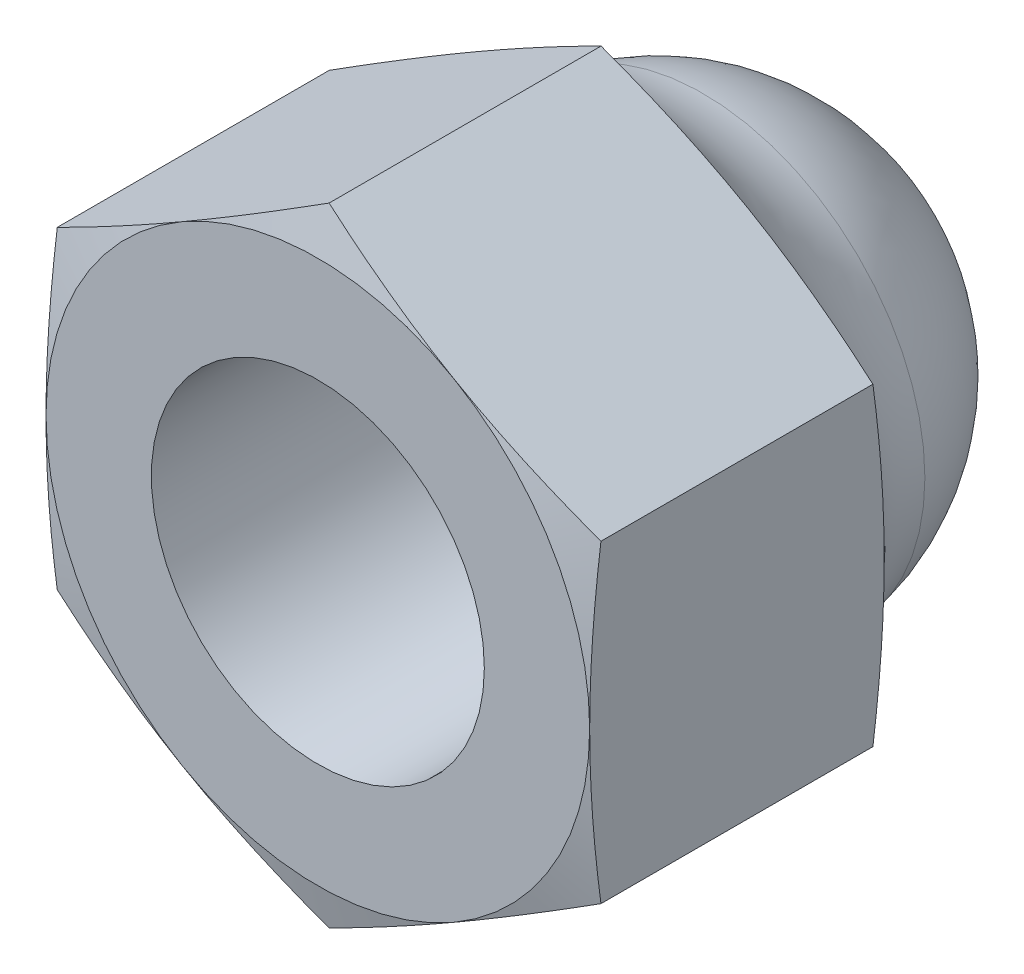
ISO-10303-21;
HEADER;
FILE_DESCRIPTION(('STEP AP214'),'2;1');
FILE_NAME('part.step','',(''),(''),'','','');
FILE_SCHEMA(('AUTOMOTIVE_DESIGN { 1 0 10303 214 1 1 1 1 }'));
ENDSEC;
DATA;
#1=APPLICATION_CONTEXT('core data for automotive mechanical design processes');
#2=APPLICATION_PROTOCOL_DEFINITION('international standard','automotive_design',2000,#1);
#3=PRODUCT_CONTEXT('',#1,'mechanical');
#4=PRODUCT('Part','Part','',(#3));
#5=PRODUCT_RELATED_PRODUCT_CATEGORY('part','',(#4));
#6=PRODUCT_DEFINITION_FORMATION('','',#4);
#7=PRODUCT_DEFINITION_CONTEXT('part definition',#1,'design');
#8=PRODUCT_DEFINITION('design','',#6,#7);
#9=PRODUCT_DEFINITION_SHAPE('','',#8);
#10=(LENGTH_UNIT() NAMED_UNIT(*) SI_UNIT(.MILLI.,.METRE.));
#11=(NAMED_UNIT(*) PLANE_ANGLE_UNIT() SI_UNIT($,.RADIAN.));
#12=(NAMED_UNIT(*) SI_UNIT($,.STERADIAN.) SOLID_ANGLE_UNIT());
#13=UNCERTAINTY_MEASURE_WITH_UNIT(LENGTH_MEASURE(1.E-05),#10,'distance_accuracy_value','');
#14=(GEOMETRIC_REPRESENTATION_CONTEXT(3) GLOBAL_UNCERTAINTY_ASSIGNED_CONTEXT((#13)) GLOBAL_UNIT_ASSIGNED_CONTEXT((#10,
#11,#12)) REPRESENTATION_CONTEXT('',''));
#15=CARTESIAN_POINT('',(0.,0.,0.));
#16=DIRECTION('',(0.,0.,1.));
#17=DIRECTION('',(1.,0.,0.));
#18=AXIS2_PLACEMENT_3D('',#15,#16,#17);
#19=CARTESIAN_POINT('',(0.,13.856406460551,12.9999999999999));
#20=DIRECTION('',(0.499999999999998,-0.86602540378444,0.));
#21=DIRECTION('',(0.866025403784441,0.5,0.));
#22=AXIS2_PLACEMENT_3D('',#19,#20,#21);
#23=PLANE('',#22);
#24=CARTESIAN_POINT('',(-12.0002000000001,6.92808776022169,0.497453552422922));
#25=CARTESIAN_POINT('',(-11.5018535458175,7.21580821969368,0.420327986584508));
#26=CARTESIAN_POINT('',(-11.0026035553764,7.50405033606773,0.350310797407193));
#27=CARTESIAN_POINT('',(-10.0023405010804,8.08155247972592,0.227297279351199));
#28=CARTESIAN_POINT('',(-9.50132680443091,8.37081287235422,0.174307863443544));
#29=CARTESIAN_POINT('',(-8.50057386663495,8.94859785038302,0.0884432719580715));
#30=CARTESIAN_POINT('',(-8.00084139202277,9.23711852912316,0.0554657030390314));
#31=CARTESIAN_POINT('',(-7.00073918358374,9.81452780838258,0.0112461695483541));
#32=CARTESIAN_POINT('',(-6.50036959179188,10.1034163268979,0.));
#33=CARTESIAN_POINT('',(-5.49963040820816,10.6811933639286,0.));
#34=CARTESIAN_POINT('',(-4.99926081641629,10.9700818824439,0.0112461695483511));
#35=CARTESIAN_POINT('',(-3.99915860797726,11.5474911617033,0.0554657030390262));
#36=CARTESIAN_POINT('',(-3.49942613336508,11.8360118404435,0.0884432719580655));
#37=CARTESIAN_POINT('',(-2.49867319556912,12.4137968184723,0.174307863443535));
#38=CARTESIAN_POINT('',(-1.99765949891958,12.7030572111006,0.227297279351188));
#39=CARTESIAN_POINT('',(-0.997396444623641,13.2805593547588,0.350310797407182));
#40=CARTESIAN_POINT('',(-0.498146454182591,13.5688014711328,0.4203279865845));
#41=CARTESIAN_POINT('',(0.000200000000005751,13.8565219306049,0.497453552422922));
#42=B_SPLINE_CURVE_WITH_KNOTS('',3,(#24,#25,#26,#27,#28,#29,#30,#31,#32,#33,#34,#35,#36,#37,#38,
#39,#40,#41),.UNSPECIFIED.,.F.,.F.,(4,2,2,2,2,2,2,2,4),(0.,1.74185054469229,3.48440735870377,
5.21797126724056,6.95119970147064,8.68442813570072,10.4179920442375,12.160548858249,
13.9023994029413),.UNSPECIFIED.);
#43=CARTESIAN_POINT('',(-12.,6.9282032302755,0.497422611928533));
#44=VERTEX_POINT('',#43);
#45=CARTESIAN_POINT('',(-5.99999999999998,10.3923048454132,0.));
#46=VERTEX_POINT('',#45);
#47=EDGE_CURVE('E330',#44,#46,#42,.T.);
#48=ORIENTED_EDGE('',*,*,#47,.F.);
#49=DIRECTION('',(0.,0.,-1.));
#50=VECTOR('',#49,1.);
#51=CARTESIAN_POINT('',(-12.,6.9282032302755,12.9999999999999));
#52=LINE('',#51,#50);
#53=CARTESIAN_POINT('',(-12.,6.9282032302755,12.5025773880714));
#54=VERTEX_POINT('',#53);
#55=EDGE_CURVE('E267',#54,#44,#52,.T.);
#56=ORIENTED_EDGE('',*,*,#55,.F.);
#57=CARTESIAN_POINT('',(0.000200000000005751,13.8565219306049,12.502546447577));
#58=CARTESIAN_POINT('',(-0.498146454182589,13.5688014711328,12.5796720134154));
#59=CARTESIAN_POINT('',(-0.99739644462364,13.2805593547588,12.6496892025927));
#60=CARTESIAN_POINT('',(-1.99765949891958,12.7030572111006,12.7727027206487));
#61=CARTESIAN_POINT('',(-2.49867319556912,12.4137968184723,12.8256921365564));
#62=CARTESIAN_POINT('',(-3.49942613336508,11.8360118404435,12.9115567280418));
#63=CARTESIAN_POINT('',(-3.99915860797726,11.5474911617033,12.9445342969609));
#64=CARTESIAN_POINT('',(-4.99926081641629,10.9700818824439,12.9887538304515));
#65=CARTESIAN_POINT('',(-5.49963040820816,10.6811933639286,12.9999999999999));
#66=CARTESIAN_POINT('',(-6.50036959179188,10.1034163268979,12.9999999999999));
#67=CARTESIAN_POINT('',(-7.00073918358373,9.81452780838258,12.9887538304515));
#68=CARTESIAN_POINT('',(-8.00084139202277,9.23711852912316,12.9445342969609));
#69=CARTESIAN_POINT('',(-8.50057386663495,8.94859785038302,12.9115567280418));
#70=CARTESIAN_POINT('',(-9.50132680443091,8.37081287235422,12.8256921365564));
#71=CARTESIAN_POINT('',(-10.0023405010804,8.08155247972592,12.7727027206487));
#72=CARTESIAN_POINT('',(-11.0026035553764,7.50405033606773,12.6496892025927));
#73=CARTESIAN_POINT('',(-11.5018535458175,7.21580821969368,12.5796720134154));
#74=CARTESIAN_POINT('',(-12.0002000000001,6.92808776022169,12.502546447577));
#75=B_SPLINE_CURVE_WITH_KNOTS('',3,(#57,#58,#59,#60,#61,#62,#63,#64,#65,#66,#67,#68,#69,#70,#71,
#72,#73,#74),.UNSPECIFIED.,.F.,.F.,(4,2,2,2,2,2,2,2,4),(0.,1.74185054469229,3.48440735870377,
5.21797126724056,6.95119970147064,8.68442813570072,10.4179920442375,12.160548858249,
13.9023994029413),.UNSPECIFIED.);
#76=CARTESIAN_POINT('',(-5.99999999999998,10.3923048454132,12.9999999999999));
#77=VERTEX_POINT('',#76);
#78=EDGE_CURVE('E240',#77,#54,#75,.T.);
#79=ORIENTED_EDGE('',*,*,#78,.F.);
#80=CARTESIAN_POINT('',(0.,13.856406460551,12.5025773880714));
#81=VERTEX_POINT('',#80);
#82=EDGE_CURVE('E497',#81,#77,#75,.T.);
#83=ORIENTED_EDGE('',*,*,#82,.F.);
#84=DIRECTION('',(0.,0.,-1.));
#85=VECTOR('',#84,1.);
#86=CARTESIAN_POINT('',(0.,13.856406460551,12.9999999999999));
#87=LINE('',#86,#85);
#88=CARTESIAN_POINT('',(0.,13.856406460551,0.497422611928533));
#89=VERTEX_POINT('',#88);
#90=EDGE_CURVE('E496',#81,#89,#87,.T.);
#91=ORIENTED_EDGE('',*,*,#90,.T.);
#92=EDGE_CURVE('E188',#46,#89,#42,.T.);
#93=ORIENTED_EDGE('',*,*,#92,.F.);
#94=EDGE_LOOP('',(#48,#56,#79,#83,#91,#93));
#95=FACE_BOUND('',#94,.T.);
#96=ADVANCED_FACE('F36',(#95),#23,.F.);
#97=CARTESIAN_POINT('',(-12.,6.9282032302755,12.9999999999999));
#98=DIRECTION('',(1.,0.,0.));
#99=DIRECTION('',(0.,1.,0.));
#100=AXIS2_PLACEMENT_3D('',#97,#98,#99);
#101=PLANE('',#100);
#102=CARTESIAN_POINT('',(-12.,-18.5110961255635,2.69567260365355));
#103=CARTESIAN_POINT('',(-11.9999999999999,-17.9641972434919,2.57274101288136));
#104=CARTESIAN_POINT('',(-11.9999999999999,-17.4169611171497,2.4512833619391));
#105=CARTESIAN_POINT('',(-11.9999999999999,-16.3216481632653,2.21211260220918));
#106=CARTESIAN_POINT('',(-11.9999999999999,-15.7735713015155,2.09439965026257));
#107=CARTESIAN_POINT('',(-11.9999999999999,-14.6759646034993,1.86342187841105));
#108=CARTESIAN_POINT('',(-11.9999999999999,-14.1264339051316,1.75016114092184));
#109=CARTESIAN_POINT('',(-11.9999999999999,-13.0262409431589,1.52927874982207));
#110=CARTESIAN_POINT('',(-11.9999999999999,-12.4755786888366,1.42165705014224));
#111=CARTESIAN_POINT('',(-11.9999999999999,-11.3780358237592,1.2143664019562));
#112=CARTESIAN_POINT('',(-11.9999999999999,-10.8311674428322,1.11463301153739));
#113=CARTESIAN_POINT('',(-11.9999999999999,-9.7359363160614,0.923670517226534));
#114=CARTESIAN_POINT('',(-11.9999999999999,-9.18757356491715,0.832441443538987));
#115=CARTESIAN_POINT('',(-11.9999999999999,-8.08922989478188,0.660502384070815));
#116=CARTESIAN_POINT('',(-11.9999999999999,-7.53924910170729,0.579791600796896));
#117=CARTESIAN_POINT('',(-11.9999999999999,-6.43753286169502,0.431233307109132));
#118=CARTESIAN_POINT('',(-12.,-5.88579741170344,0.36338581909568));
#119=CARTESIAN_POINT('',(-12.,-4.77420396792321,0.242424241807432));
#120=CARTESIAN_POINT('',(-12.,-4.21432606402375,0.189490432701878));
#121=CARTESIAN_POINT('',(-11.9999999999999,-3.09312446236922,0.101990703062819));
#122=CARTESIAN_POINT('',(-11.9999999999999,-2.53180079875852,0.0674243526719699));
#123=CARTESIAN_POINT('',(-12.,-1.40855850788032,0.01867211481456));
#124=CARTESIAN_POINT('',(-12.,-0.846640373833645,0.00447509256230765));
#125=CARTESIAN_POINT('',(-12.,0.277333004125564,-0.00266607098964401));
#126=CARTESIAN_POINT('',(-12.,0.839388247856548,0.0043897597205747));
#127=CARTESIAN_POINT('',(-12.,1.96555186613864,0.0393808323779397));
#128=CARTESIAN_POINT('',(-12.,2.52965704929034,0.0674167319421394));
#129=CARTESIAN_POINT('',(-12.,3.65656541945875,0.142778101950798));
#130=CARTESIAN_POINT('',(-12.,4.21936857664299,0.190104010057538));
#131=CARTESIAN_POINT('',(-12.,5.34370363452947,0.301609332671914));
#132=CARTESIAN_POINT('',(-12.,5.90523426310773,0.365801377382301));
#133=CARTESIAN_POINT('',(-12.,7.0264725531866,0.508309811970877));
#134=CARTESIAN_POINT('',(-12.0000000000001,7.58618022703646,0.586626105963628));
#135=CARTESIAN_POINT('',(-12.0000000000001,8.86380356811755,0.778875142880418));
#136=CARTESIAN_POINT('',(-12.,9.58114681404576,0.89658607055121));
#137=CARTESIAN_POINT('',(-12.,11.0133231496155,1.14649080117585));
#138=CARTESIAN_POINT('',(-12.,11.7281560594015,1.27868562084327));
#139=CARTESIAN_POINT('',(-12.,13.1558741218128,1.55404136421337));
#140=CARTESIAN_POINT('',(-12.,13.8687587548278,1.69720496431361));
#141=CARTESIAN_POINT('',(-12.,15.2927836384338,1.99182633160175));
#142=CARTESIAN_POINT('',(-12.,16.0039239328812,2.14328388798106));
#143=CARTESIAN_POINT('',(-12.,17.425302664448,2.4526655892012));
#144=CARTESIAN_POINT('',(-12.,18.1355401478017,2.610594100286));
#145=CARTESIAN_POINT('',(-12.,19.5548982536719,2.93139502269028));
#146=CARTESIAN_POINT('',(-12.,20.2640188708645,3.09426745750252));
#147=CARTESIAN_POINT('',(-12.,21.6812515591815,3.42387412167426));
#148=CARTESIAN_POINT('',(-12.,22.3893637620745,3.59060778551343));
#149=CARTESIAN_POINT('',(-12.,23.8048483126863,3.92717574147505));
#150=CARTESIAN_POINT('',(-12.,24.5122206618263,4.09701002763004));
#151=CARTESIAN_POINT('',(-12.,26.6091583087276,4.60435907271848));
#152=CARTESIAN_POINT('',(-12.0000000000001,27.9978639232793,4.94542535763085));
#153=CARTESIAN_POINT('',(-12.0000000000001,30.7737273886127,5.63403087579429));
#154=CARTESIAN_POINT('',(-12.0000000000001,32.1608851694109,5.98157039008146));
#155=CARTESIAN_POINT('',(-12.0000000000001,34.9312190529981,6.68051050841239));
#156=CARTESIAN_POINT('',(-12.0000000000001,36.3143975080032,7.03190179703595));
#157=CARTESIAN_POINT('',(-12.0000000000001,38.388490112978,7.56147359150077));
#158=CARTESIAN_POINT('',(-12.0000000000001,39.079723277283,7.73840688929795));
#159=CARTESIAN_POINT('',(-12.0000000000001,40.4620031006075,8.09299867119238));
#160=CARTESIAN_POINT('',(-12.0000000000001,41.1530497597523,8.27065715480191));
#161=CARTESIAN_POINT('',(-12.0000000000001,41.8440167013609,8.44862526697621));
#162=B_SPLINE_CURVE_WITH_KNOTS('',3,(#102,#103,#104,#105,#106,#107,#108,#109,#110,#111,#112,
#113,#114,#115,#116,#117,#118,#119,#120,#121,#122,#123,#124,#125,#126,#127,#128,#129,#130,#131,
#132,#133,#134,#135,#136,#137,#138,#139,#140,#141,#142,#143,#144,#145,#146,#147,#148,#149,#150,
#151,#152,#153,#154,#155,#156,#157,#158,#159,#160,#161),.UNSPECIFIED.,.F.,.F.,(4,2,2,2,2,2,2,2,
2,2,2,2,2,2,2,2,2,2,2,2,2,2,2,2,2,2,2,2,2,4),(0.,1.68164127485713,3.36335289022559,
5.04657218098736,6.72977771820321,8.39738893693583,10.0650060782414,11.7324967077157,
13.399990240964,15.0868515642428,16.7736734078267,18.4595728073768,20.1454699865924,
21.8395079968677,23.5335844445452,25.2289331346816,26.9242703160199,29.1048720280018,
31.2856269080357,33.4669156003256,35.6481488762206,37.8308789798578,40.0136194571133,
42.1960422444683,44.3784608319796,48.6683599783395,52.958445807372,57.2397859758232,
59.380341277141,61.5208951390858),.UNSPECIFIED.);
#163=CARTESIAN_POINT('',(-12.,-6.92820323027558,0.497422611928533));
#164=VERTEX_POINT('',#163);
#165=CARTESIAN_POINT('',(-12.,0.,0.));
#166=VERTEX_POINT('',#165);
#167=EDGE_CURVE('E52',#164,#166,#162,.T.);
#168=ORIENTED_EDGE('',*,*,#167,.F.);
#169=DIRECTION('',(0.,0.,-1.));
#170=VECTOR('',#169,1.);
#171=CARTESIAN_POINT('',(-12.,-6.92820323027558,12.9999999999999));
#172=LINE('',#171,#170);
#173=CARTESIAN_POINT('',(-12.,-6.92820323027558,12.5025773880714));
#174=VERTEX_POINT('',#173);
#175=EDGE_CURVE('E260',#174,#164,#172,.T.);
#176=ORIENTED_EDGE('',*,*,#175,.F.);
#177=CARTESIAN_POINT('',(-12.,-18.5110961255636,10.3043273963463));
#178=CARTESIAN_POINT('',(-12.,-17.964197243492,10.4272589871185));
#179=CARTESIAN_POINT('',(-11.9999999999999,-17.4169611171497,10.5487166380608));
#180=CARTESIAN_POINT('',(-11.9999999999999,-16.3216481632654,10.7878873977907));
#181=CARTESIAN_POINT('',(-11.9999999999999,-15.7735713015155,10.9056003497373));
#182=CARTESIAN_POINT('',(-11.9999999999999,-14.6759646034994,11.1365781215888));
#183=CARTESIAN_POINT('',(-11.9999999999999,-14.1264339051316,11.2498388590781));
#184=CARTESIAN_POINT('',(-11.9999999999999,-13.0262409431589,11.4707212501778));
#185=CARTESIAN_POINT('',(-11.9999999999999,-12.4755786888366,11.5783429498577));
#186=CARTESIAN_POINT('',(-11.9999999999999,-11.3780358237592,11.7856335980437));
#187=CARTESIAN_POINT('',(-11.9999999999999,-10.8311674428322,11.8853669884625));
#188=CARTESIAN_POINT('',(-11.9999999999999,-9.73593631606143,12.0763294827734));
#189=CARTESIAN_POINT('',(-11.9999999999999,-9.18757356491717,12.1675585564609));
#190=CARTESIAN_POINT('',(-11.9999999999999,-8.0892298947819,12.3394976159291));
#191=CARTESIAN_POINT('',(-11.9999999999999,-7.53924910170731,12.420208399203));
#192=CARTESIAN_POINT('',(-11.9999999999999,-6.43753286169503,12.5687666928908));
#193=CARTESIAN_POINT('',(-12.,-5.88579741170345,12.6366141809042));
#194=CARTESIAN_POINT('',(-12.,-4.77420396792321,12.7575757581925));
#195=CARTESIAN_POINT('',(-12.,-4.21432606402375,12.810509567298));
#196=CARTESIAN_POINT('',(-11.9999999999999,-3.09312446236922,12.8980092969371));
#197=CARTESIAN_POINT('',(-11.9999999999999,-2.53180079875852,12.9325756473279));
#198=CARTESIAN_POINT('',(-12.,-1.40855850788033,12.9813278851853));
#199=CARTESIAN_POINT('',(-12.,-0.846640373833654,12.9955249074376));
#200=CARTESIAN_POINT('',(-12.,0.277333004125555,13.0026660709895));
#201=CARTESIAN_POINT('',(-12.,0.839388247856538,12.9956102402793));
#202=CARTESIAN_POINT('',(-12.,1.96555186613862,12.960619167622));
#203=CARTESIAN_POINT('',(-12.,2.52965704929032,12.9325832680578));
#204=CARTESIAN_POINT('',(-12.,3.65656541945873,12.8572218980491));
#205=CARTESIAN_POINT('',(-12.,4.21936857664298,12.8098959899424));
#206=CARTESIAN_POINT('',(-12.,5.34370363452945,12.698390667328));
#207=CARTESIAN_POINT('',(-12.,5.90523426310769,12.6341986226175));
#208=CARTESIAN_POINT('',(-12.,7.02647255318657,12.4916901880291));
#209=CARTESIAN_POINT('',(-12.,7.58618022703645,12.4133738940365));
#210=CARTESIAN_POINT('',(-12.,8.86380356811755,12.2211248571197));
#211=CARTESIAN_POINT('',(-12.,9.58114681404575,12.1034139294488));
#212=CARTESIAN_POINT('',(-12.,11.0133231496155,11.853509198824));
#213=CARTESIAN_POINT('',(-12.,11.7281560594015,11.7213143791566));
#214=CARTESIAN_POINT('',(-12.,13.1558741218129,11.4459586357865));
#215=CARTESIAN_POINT('',(-12.,13.8687587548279,11.3027950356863));
#216=CARTESIAN_POINT('',(-12.,15.2927836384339,11.0081736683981));
#217=CARTESIAN_POINT('',(-12.,16.0039239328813,10.8567161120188));
#218=CARTESIAN_POINT('',(-12.,17.4253026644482,10.5473344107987));
#219=CARTESIAN_POINT('',(-12.,18.1355401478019,10.3894058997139));
#220=CARTESIAN_POINT('',(-12.,19.5548982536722,10.0686049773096));
#221=CARTESIAN_POINT('',(-12.,20.2640188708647,9.90573254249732));
#222=CARTESIAN_POINT('',(-12.,21.6812515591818,9.57612587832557));
#223=CARTESIAN_POINT('',(-12.,22.3893637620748,9.40939221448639));
#224=CARTESIAN_POINT('',(-12.,23.8048483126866,9.07282425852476));
#225=CARTESIAN_POINT('',(-12.,24.5122206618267,8.90298997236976));
#226=CARTESIAN_POINT('',(-12.,26.6091583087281,8.39564092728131));
#227=CARTESIAN_POINT('',(-12.0000000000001,27.9978639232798,8.05457464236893));
#228=CARTESIAN_POINT('',(-12.0000000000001,30.7737273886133,7.36596912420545));
#229=CARTESIAN_POINT('',(-12.0000000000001,32.1608851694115,7.01842960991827));
#230=CARTESIAN_POINT('',(-12.0000000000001,34.9312190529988,6.31948949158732));
#231=CARTESIAN_POINT('',(-12.0000000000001,36.314397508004,5.96809820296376));
#232=CARTESIAN_POINT('',(-12.0000000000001,38.3884901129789,5.4385264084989));
#233=CARTESIAN_POINT('',(-12.0000000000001,39.0797232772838,5.26159311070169));
#234=CARTESIAN_POINT('',(-12.0000000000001,40.4620031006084,4.9070013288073));
#235=CARTESIAN_POINT('',(-12.0000000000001,41.1530497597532,4.72934284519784));
#236=CARTESIAN_POINT('',(-12.0000000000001,41.844016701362,4.55137473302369));
#237=B_SPLINE_CURVE_WITH_KNOTS('',3,(#177,#178,#179,#180,#181,#182,#183,#184,#185,#186,#187,
#188,#189,#190,#191,#192,#193,#194,#195,#196,#197,#198,#199,#200,#201,#202,#203,#204,#205,#206,
#207,#208,#209,#210,#211,#212,#213,#214,#215,#216,#217,#218,#219,#220,#221,#222,#223,#224,#225,
#226,#227,#228,#229,#230,#231,#232,#233,#234,#235,#236),.UNSPECIFIED.,.F.,.F.,(4,2,2,2,2,2,2,2,
2,2,2,2,2,2,2,2,2,2,2,2,2,2,2,2,2,2,2,2,2,4),(0.,1.68164127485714,3.3633528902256,
5.04657218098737,6.72977771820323,8.39738893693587,10.0650060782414,11.7324967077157,
13.399990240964,15.0868515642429,16.7736734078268,18.4595728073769,20.1454699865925,
21.8395079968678,23.5335844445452,25.2289331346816,26.9242703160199,29.1048720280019,
31.2856269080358,33.4669156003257,35.6481488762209,37.8308789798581,40.0136194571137,
42.1960422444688,44.37846083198,48.6683599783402,52.9584458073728,57.2397859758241,
59.380341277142,61.5208951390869),.UNSPECIFIED.);
#238=CARTESIAN_POINT('',(-12.0000000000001,0.,12.9999999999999));
#239=VERTEX_POINT('',#238);
#240=EDGE_CURVE('E234',#239,#174,#237,.F.);
#241=ORIENTED_EDGE('',*,*,#240,.F.);
#242=EDGE_CURVE('E239',#54,#239,#237,.F.);
#243=ORIENTED_EDGE('',*,*,#242,.F.);
#244=ORIENTED_EDGE('',*,*,#55,.T.);
#245=EDGE_CURVE('E199',#166,#44,#162,.T.);
#246=ORIENTED_EDGE('',*,*,#245,.F.);
#247=EDGE_LOOP('',(#168,#176,#241,#243,#244,#246));
#248=FACE_BOUND('',#247,.T.);
#249=ADVANCED_FACE('F245',(#248),#101,.F.);
#250=CARTESIAN_POINT('',(0.,-13.8564064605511,12.9999999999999));
#251=DIRECTION('',(0.5,0.86602540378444,0.));
#252=DIRECTION('',(-0.866025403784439,0.499999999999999,0.));
#253=AXIS2_PLACEMENT_3D('',#250,#251,#252);
#254=PLANE('',#253);
#255=CARTESIAN_POINT('',(0.000200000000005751,-13.8565219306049,0.497453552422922));
#256=CARTESIAN_POINT('',(-0.498146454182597,-13.5688014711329,0.420327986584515));
#257=CARTESIAN_POINT('',(-0.997396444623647,-13.2805593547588,0.350310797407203));
#258=CARTESIAN_POINT('',(-1.99765949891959,-12.7030572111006,0.227297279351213));
#259=CARTESIAN_POINT('',(-2.49867319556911,-12.4137968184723,0.174307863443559));
#260=CARTESIAN_POINT('',(-3.49942613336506,-11.8360118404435,0.0884432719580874));
#261=CARTESIAN_POINT('',(-3.99915860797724,-11.5474911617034,0.0554657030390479));
#262=CARTESIAN_POINT('',(-4.99926081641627,-10.970081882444,0.0112461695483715));
#263=CARTESIAN_POINT('',(-5.49963040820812,-10.6811933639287,0.));
#264=CARTESIAN_POINT('',(-6.50036959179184,-10.103416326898,0.));
#265=CARTESIAN_POINT('',(-7.00073918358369,-9.81452780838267,0.0112461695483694));
#266=CARTESIAN_POINT('',(-8.00084139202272,-9.23711852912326,0.0554657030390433));
#267=CARTESIAN_POINT('',(-8.5005738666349,-8.94859785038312,0.0884432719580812));
#268=CARTESIAN_POINT('',(-9.50132680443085,-8.37081287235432,0.174307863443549));
#269=CARTESIAN_POINT('',(-10.0023405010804,-8.08155247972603,0.227297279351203));
#270=CARTESIAN_POINT('',(-11.0026035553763,-7.50405033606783,0.350310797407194));
#271=CARTESIAN_POINT('',(-11.5018535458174,-7.21580821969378,0.420327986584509));
#272=CARTESIAN_POINT('',(-12.0002,-6.92808776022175,0.497453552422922));
#273=B_SPLINE_CURVE_WITH_KNOTS('',3,(#255,#256,#257,#258,#259,#260,#261,#262,#263,#264,#265,
#266,#267,#268,#269,#270,#271,#272),.UNSPECIFIED.,.F.,.F.,(4,2,2,2,2,2,2,2,4),(0.,
1.74185054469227,3.48440735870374,5.21797126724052,6.95119970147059,8.68442813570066,
10.4179920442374,12.1605488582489,13.9023994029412),.UNSPECIFIED.);
#274=CARTESIAN_POINT('',(0.,-13.8564064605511,0.497422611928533));
#275=VERTEX_POINT('',#274);
#276=CARTESIAN_POINT('',(-5.99999999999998,-10.3923048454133,0.));
#277=VERTEX_POINT('',#276);
#278=EDGE_CURVE('E60',#275,#277,#273,.T.);
#279=ORIENTED_EDGE('',*,*,#278,.F.);
#280=DIRECTION('',(0.,0.,-1.));
#281=VECTOR('',#280,1.);
#282=CARTESIAN_POINT('',(0.,-13.8564064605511,12.9999999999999));
#283=LINE('',#282,#281);
#284=CARTESIAN_POINT('',(0.,-13.8564064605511,12.5025773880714));
#285=VERTEX_POINT('',#284);
#286=EDGE_CURVE('E268',#285,#275,#283,.T.);
#287=ORIENTED_EDGE('',*,*,#286,.F.);
#288=CARTESIAN_POINT('',(-12.0002,-6.92808776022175,12.502546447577));
#289=CARTESIAN_POINT('',(-11.5018535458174,-7.21580821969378,12.5796720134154));
#290=CARTESIAN_POINT('',(-11.0026035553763,-7.50405033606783,12.6496892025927));
#291=CARTESIAN_POINT('',(-10.0023405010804,-8.08155247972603,12.7727027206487));
#292=CARTESIAN_POINT('',(-9.50132680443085,-8.37081287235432,12.8256921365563));
#293=CARTESIAN_POINT('',(-8.5005738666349,-8.94859785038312,12.9115567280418));
#294=CARTESIAN_POINT('',(-8.00084139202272,-9.23711852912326,12.9445342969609));
#295=CARTESIAN_POINT('',(-7.00073918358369,-9.81452780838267,12.9887538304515));
#296=CARTESIAN_POINT('',(-6.50036959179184,-10.103416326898,12.9999999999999));
#297=CARTESIAN_POINT('',(-5.49963040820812,-10.6811933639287,12.9999999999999));
#298=CARTESIAN_POINT('',(-4.99926081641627,-10.970081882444,12.9887538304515));
#299=CARTESIAN_POINT('',(-3.99915860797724,-11.5474911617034,12.9445342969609));
#300=CARTESIAN_POINT('',(-3.49942613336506,-11.8360118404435,12.9115567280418));
#301=CARTESIAN_POINT('',(-2.49867319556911,-12.4137968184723,12.8256921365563));
#302=CARTESIAN_POINT('',(-1.99765949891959,-12.7030572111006,12.7727027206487));
#303=CARTESIAN_POINT('',(-0.997396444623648,-13.2805593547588,12.6496892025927));
#304=CARTESIAN_POINT('',(-0.498146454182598,-13.5688014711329,12.5796720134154));
#305=CARTESIAN_POINT('',(0.000200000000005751,-13.8565219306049,12.502546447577));
#306=B_SPLINE_CURVE_WITH_KNOTS('',3,(#288,#289,#290,#291,#292,#293,#294,#295,#296,#297,#298,
#299,#300,#301,#302,#303,#304,#305),.UNSPECIFIED.,.F.,.F.,(4,2,2,2,2,2,2,2,4),(0.,
1.74185054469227,3.48440735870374,5.21797126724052,6.95119970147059,8.68442813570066,
10.4179920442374,12.1605488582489,13.9023994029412),.UNSPECIFIED.);
#307=CARTESIAN_POINT('',(-5.99999999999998,-10.3923048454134,12.9999999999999));
#308=VERTEX_POINT('',#307);
#309=EDGE_CURVE('E228',#308,#285,#306,.T.);
#310=ORIENTED_EDGE('',*,*,#309,.F.);
#311=EDGE_CURVE('E233',#174,#308,#306,.T.);
#312=ORIENTED_EDGE('',*,*,#311,.F.);
#313=ORIENTED_EDGE('',*,*,#175,.T.);
#314=EDGE_CURVE('E178',#277,#164,#273,.T.);
#315=ORIENTED_EDGE('',*,*,#314,.F.);
#316=EDGE_LOOP('',(#279,#287,#310,#312,#313,#315));
#317=FACE_BOUND('',#316,.T.);
#318=ADVANCED_FACE('F209',(#317),#254,.F.);
#319=CARTESIAN_POINT('',(0.,-13.8564064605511,12.9999999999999));
#320=DIRECTION('',(-0.499999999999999,0.866025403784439,0.));
#321=DIRECTION('',(-0.86602540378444,-0.500000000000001,0.));
#322=AXIS2_PLACEMENT_3D('',#319,#320,#321);
#323=PLANE('',#322);
#324=CARTESIAN_POINT('',(12.0002,-6.92808776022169,0.497453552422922));
#325=CARTESIAN_POINT('',(11.5018535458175,-7.21580821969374,0.42032798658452));
#326=CARTESIAN_POINT('',(11.0026035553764,-7.50405033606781,0.350310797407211));
#327=CARTESIAN_POINT('',(10.0023405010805,-8.08155247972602,0.227297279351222));
#328=CARTESIAN_POINT('',(9.50132680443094,-8.37081287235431,0.174307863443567));
#329=CARTESIAN_POINT('',(8.50057386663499,-8.94859785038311,0.0884432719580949));
#330=CARTESIAN_POINT('',(8.00084139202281,-9.23711852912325,0.0554657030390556));
#331=CARTESIAN_POINT('',(7.00073918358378,-9.81452780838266,0.0112461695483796));
#332=CARTESIAN_POINT('',(6.50036959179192,-10.103416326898,0.));
#333=CARTESIAN_POINT('',(5.4996304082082,-10.6811933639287,0.));
#334=CARTESIAN_POINT('',(4.99926081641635,-10.970081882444,0.011246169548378));
#335=CARTESIAN_POINT('',(3.99915860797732,-11.5474911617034,0.0554657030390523));
#336=CARTESIAN_POINT('',(3.49942613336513,-11.8360118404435,0.0884432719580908));
#337=CARTESIAN_POINT('',(2.49867319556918,-12.4137968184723,0.17430786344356));
#338=CARTESIAN_POINT('',(1.99765949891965,-12.7030572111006,0.227297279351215));
#339=CARTESIAN_POINT('',(0.997396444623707,-13.2805593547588,0.350310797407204));
#340=CARTESIAN_POINT('',(0.498146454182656,-13.5688014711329,0.420327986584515));
#341=CARTESIAN_POINT('',(-0.00019999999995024,-13.8565219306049,0.497453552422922));
#342=B_SPLINE_CURVE_WITH_KNOTS('',3,(#324,#325,#326,#327,#328,#329,#330,#331,#332,#333,#334,
#335,#336,#337,#338,#339,#340,#341),.UNSPECIFIED.,.F.,.F.,(4,2,2,2,2,2,2,2,4),(0.,
1.74185054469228,3.48440735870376,5.21797126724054,6.95119970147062,8.68442813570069,
10.4179920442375,12.160548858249,13.9023994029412),.UNSPECIFIED.);
#343=CARTESIAN_POINT('',(12.,-6.92820323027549,0.497422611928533));
#344=VERTEX_POINT('',#343);
#345=CARTESIAN_POINT('',(6.00000000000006,-10.3923048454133,0.));
#346=VERTEX_POINT('',#345);
#347=EDGE_CURVE('E193',#344,#346,#342,.T.);
#348=ORIENTED_EDGE('',*,*,#347,.F.);
#349=DIRECTION('',(0.,0.,-1.));
#350=VECTOR('',#349,1.);
#351=CARTESIAN_POINT('',(12.,-6.92820323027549,12.9999999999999));
#352=LINE('',#351,#350);
#353=CARTESIAN_POINT('',(12.,-6.92820323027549,12.5025773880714));
#354=VERTEX_POINT('',#353);
#355=EDGE_CURVE('E273',#354,#344,#352,.T.);
#356=ORIENTED_EDGE('',*,*,#355,.F.);
#357=CARTESIAN_POINT('',(-0.00019999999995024,-13.8565219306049,12.502546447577));
#358=CARTESIAN_POINT('',(0.498146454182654,-13.5688014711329,12.5796720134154));
#359=CARTESIAN_POINT('',(0.997396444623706,-13.2805593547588,12.6496892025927));
#360=CARTESIAN_POINT('',(1.99765949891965,-12.7030572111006,12.7727027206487));
#361=CARTESIAN_POINT('',(2.49867319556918,-12.4137968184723,12.8256921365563));
#362=CARTESIAN_POINT('',(3.49942613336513,-11.8360118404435,12.9115567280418));
#363=CARTESIAN_POINT('',(3.99915860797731,-11.5474911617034,12.9445342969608));
#364=CARTESIAN_POINT('',(4.99926081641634,-10.970081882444,12.9887538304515));
#365=CARTESIAN_POINT('',(5.4996304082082,-10.6811933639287,12.9999999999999));
#366=CARTESIAN_POINT('',(6.50036959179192,-10.103416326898,12.9999999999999));
#367=CARTESIAN_POINT('',(7.00073918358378,-9.81452780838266,12.9887538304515));
#368=CARTESIAN_POINT('',(8.00084139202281,-9.23711852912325,12.9445342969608));
#369=CARTESIAN_POINT('',(8.50057386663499,-8.94859785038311,12.9115567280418));
#370=CARTESIAN_POINT('',(9.50132680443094,-8.37081287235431,12.8256921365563));
#371=CARTESIAN_POINT('',(10.0023405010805,-8.08155247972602,12.7727027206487));
#372=CARTESIAN_POINT('',(11.0026035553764,-7.50405033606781,12.6496892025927));
#373=CARTESIAN_POINT('',(11.5018535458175,-7.21580821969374,12.5796720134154));
#374=CARTESIAN_POINT('',(12.0002,-6.92808776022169,12.502546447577));
#375=B_SPLINE_CURVE_WITH_KNOTS('',3,(#357,#358,#359,#360,#361,#362,#363,#364,#365,#366,#367,
#368,#369,#370,#371,#372,#373,#374),.UNSPECIFIED.,.F.,.F.,(4,2,2,2,2,2,2,2,4),(0.,
1.74185054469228,3.48440735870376,5.21797126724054,6.95119970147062,8.68442813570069,
10.4179920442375,12.160548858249,13.9023994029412),.UNSPECIFIED.);
#376=CARTESIAN_POINT('',(6.00000000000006,-10.3923048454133,12.9999999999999));
#377=VERTEX_POINT('',#376);
#378=EDGE_CURVE('E215',#377,#354,#375,.T.);
#379=ORIENTED_EDGE('',*,*,#378,.F.);
#380=EDGE_CURVE('E221',#285,#377,#375,.T.);
#381=ORIENTED_EDGE('',*,*,#380,.F.);
#382=ORIENTED_EDGE('',*,*,#286,.T.);
#383=EDGE_CURVE('E201',#346,#275,#342,.T.);
#384=ORIENTED_EDGE('',*,*,#383,.F.);
#385=EDGE_LOOP('',(#348,#356,#379,#381,#382,#384));
#386=FACE_BOUND('',#385,.T.);
#387=ADVANCED_FACE('F205',(#386),#323,.F.);
#388=CARTESIAN_POINT('',(12.,6.9282032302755,12.9999999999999));
#389=DIRECTION('',(-1.,0.,0.));
#390=DIRECTION('',(0.,-1.,0.));
#391=AXIS2_PLACEMENT_3D('',#388,#389,#390);
#392=PLANE('',#391);
#393=CARTESIAN_POINT('',(12.,-18.5110961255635,2.69567260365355));
#394=CARTESIAN_POINT('',(12.,-17.9641972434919,2.57274101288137));
#395=CARTESIAN_POINT('',(12.,-17.4169611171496,2.4512833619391));
#396=CARTESIAN_POINT('',(12.,-16.3216481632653,2.21211260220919));
#397=CARTESIAN_POINT('',(12.,-15.7735713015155,2.09439965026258));
#398=CARTESIAN_POINT('',(12.,-14.6759646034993,1.86342187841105));
#399=CARTESIAN_POINT('',(12.,-14.1264339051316,1.75016114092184));
#400=CARTESIAN_POINT('',(12.,-13.0262409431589,1.52927874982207));
#401=CARTESIAN_POINT('',(12.,-12.4755786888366,1.42165705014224));
#402=CARTESIAN_POINT('',(12.,-11.3780358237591,1.21436640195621));
#403=CARTESIAN_POINT('',(12.,-10.8311674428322,1.1146330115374));
#404=CARTESIAN_POINT('',(12.,-9.73593631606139,0.92367051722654));
#405=CARTESIAN_POINT('',(12.,-9.18757356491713,0.832441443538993));
#406=CARTESIAN_POINT('',(12.,-8.08922989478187,0.660502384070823));
#407=CARTESIAN_POINT('',(12.,-7.53924910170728,0.579791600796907));
#408=CARTESIAN_POINT('',(12.,-6.43753286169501,0.431233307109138));
#409=CARTESIAN_POINT('',(12.,-5.88579741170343,0.36338581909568));
#410=CARTESIAN_POINT('',(12.,-4.7742039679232,0.242424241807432));
#411=CARTESIAN_POINT('',(12.,-4.21432606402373,0.189490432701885));
#412=CARTESIAN_POINT('',(12.,-3.0931244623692,0.101990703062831));
#413=CARTESIAN_POINT('',(12.,-2.53180079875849,0.0674243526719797));
#414=CARTESIAN_POINT('',(12.,-1.4085585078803,0.0186721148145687));
#415=CARTESIAN_POINT('',(12.,-0.846640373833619,0.00447509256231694));
#416=CARTESIAN_POINT('',(12.,0.277333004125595,-0.00266607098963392));
#417=CARTESIAN_POINT('',(12.,0.83938824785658,0.00438975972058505));
#418=CARTESIAN_POINT('',(12.,1.96555186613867,0.0393808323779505));
#419=CARTESIAN_POINT('',(12.,2.52965704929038,0.0674167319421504));
#420=CARTESIAN_POINT('',(12.,3.65656541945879,0.142778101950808));
#421=CARTESIAN_POINT('',(12.,4.21936857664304,0.190104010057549));
#422=CARTESIAN_POINT('',(12.,5.34370363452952,0.301609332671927));
#423=CARTESIAN_POINT('',(12.,5.90523426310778,0.365801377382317));
#424=CARTESIAN_POINT('',(12.,7.02647255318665,0.508309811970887));
#425=CARTESIAN_POINT('',(12.0000000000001,7.58618022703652,0.586626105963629));
#426=CARTESIAN_POINT('',(12.0000000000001,8.8638035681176,0.778875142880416));
#427=CARTESIAN_POINT('',(12.,9.58114681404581,0.89658607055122));
#428=CARTESIAN_POINT('',(12.,11.0133231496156,1.14649080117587));
#429=CARTESIAN_POINT('',(12.,11.7281560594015,1.27868562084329));
#430=CARTESIAN_POINT('',(12.,13.1558741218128,1.55404136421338));
#431=CARTESIAN_POINT('',(12.,13.8687587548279,1.69720496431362));
#432=CARTESIAN_POINT('',(12.,15.2927836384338,1.99182633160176));
#433=CARTESIAN_POINT('',(12.,16.0039239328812,2.14328388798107));
#434=CARTESIAN_POINT('',(12.,17.4253026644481,2.45266558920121));
#435=CARTESIAN_POINT('',(12.,18.1355401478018,2.61059410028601));
#436=CARTESIAN_POINT('',(12.,19.554898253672,2.93139502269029));
#437=CARTESIAN_POINT('',(12.,20.2640188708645,3.09426745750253));
#438=CARTESIAN_POINT('',(12.,21.6812515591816,3.42387412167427));
#439=CARTESIAN_POINT('',(12.,22.3893637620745,3.59060778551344));
#440=CARTESIAN_POINT('',(12.,23.8048483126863,3.92717574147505));
#441=CARTESIAN_POINT('',(12.,24.5122206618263,4.09701002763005));
#442=CARTESIAN_POINT('',(12.0000000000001,26.6091583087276,4.60435907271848));
#443=CARTESIAN_POINT('',(12.0000000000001,27.9978639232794,4.94542535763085));
#444=CARTESIAN_POINT('',(12.0000000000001,30.7737273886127,5.63403087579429));
#445=CARTESIAN_POINT('',(12.0000000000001,32.1608851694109,5.98157039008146));
#446=CARTESIAN_POINT('',(12.0000000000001,34.9312190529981,6.68051050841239));
#447=CARTESIAN_POINT('',(12.0000000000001,36.3143975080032,7.03190179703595));
#448=CARTESIAN_POINT('',(12.0000000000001,38.388490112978,7.56147359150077));
#449=CARTESIAN_POINT('',(12.0000000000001,39.079723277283,7.73840688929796));
#450=CARTESIAN_POINT('',(12.0000000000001,40.4620031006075,8.09299867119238));
#451=CARTESIAN_POINT('',(12.0000000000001,41.1530497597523,8.27065715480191));
#452=CARTESIAN_POINT('',(12.0000000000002,41.8440167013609,8.44862526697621));
#453=B_SPLINE_CURVE_WITH_KNOTS('',3,(#393,#394,#395,#396,#397,#398,#399,#400,#401,#402,#403,
#404,#405,#406,#407,#408,#409,#410,#411,#412,#413,#414,#415,#416,#417,#418,#419,#420,#421,#422,
#423,#424,#425,#426,#427,#428,#429,#430,#431,#432,#433,#434,#435,#436,#437,#438,#439,#440,#441,
#442,#443,#444,#445,#446,#447,#448,#449,#450,#451,#452),.UNSPECIFIED.,.F.,.F.,(4,2,2,2,2,2,2,2,
2,2,2,2,2,2,2,2,2,2,2,2,2,2,2,2,2,2,2,2,2,4),(0.,1.68164127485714,3.36335289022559,
5.04657218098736,6.72977771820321,8.39738893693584,10.0650060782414,11.7324967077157,
13.399990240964,15.0868515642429,16.7736734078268,18.4595728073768,20.1454699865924,
21.8395079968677,23.5335844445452,25.2289331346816,26.9242703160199,29.1048720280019,
31.2856269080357,33.4669156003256,35.6481488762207,37.8308789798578,40.0136194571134,
42.1960422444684,44.3784608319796,48.6683599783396,52.958445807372,57.2397859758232,
59.380341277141,61.5208951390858),.UNSPECIFIED.);
#454=CARTESIAN_POINT('',(12.,6.9282032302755,0.497422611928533));
#455=VERTEX_POINT('',#454);
#456=CARTESIAN_POINT('',(12.0000000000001,0.,0.));
#457=VERTEX_POINT('',#456);
#458=EDGE_CURVE('E154',#455,#457,#453,.F.);
#459=ORIENTED_EDGE('',*,*,#458,.F.);
#460=DIRECTION('',(0.,0.,-1.));
#461=VECTOR('',#460,1.);
#462=CARTESIAN_POINT('',(12.,6.9282032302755,12.9999999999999));
#463=LINE('',#462,#461);
#464=CARTESIAN_POINT('',(12.,6.9282032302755,12.5025773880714));
#465=VERTEX_POINT('',#464);
#466=EDGE_CURVE('E342',#465,#455,#463,.T.);
#467=ORIENTED_EDGE('',*,*,#466,.F.);
#468=CARTESIAN_POINT('',(12.,-18.5110961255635,10.3043273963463));
#469=CARTESIAN_POINT('',(12.,-17.9641972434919,10.4272589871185));
#470=CARTESIAN_POINT('',(12.,-17.4169611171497,10.5487166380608));
#471=CARTESIAN_POINT('',(12.,-16.3216481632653,10.7878873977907));
#472=CARTESIAN_POINT('',(12.,-15.7735713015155,10.9056003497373));
#473=CARTESIAN_POINT('',(12.,-14.6759646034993,11.1365781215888));
#474=CARTESIAN_POINT('',(12.,-14.1264339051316,11.2498388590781));
#475=CARTESIAN_POINT('',(12.,-13.0262409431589,11.4707212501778));
#476=CARTESIAN_POINT('',(12.,-12.4755786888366,11.5783429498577));
#477=CARTESIAN_POINT('',(12.,-11.3780358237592,11.7856335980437));
#478=CARTESIAN_POINT('',(12.,-10.8311674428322,11.8853669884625));
#479=CARTESIAN_POINT('',(12.,-9.73593631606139,12.0763294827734));
#480=CARTESIAN_POINT('',(12.,-9.18757356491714,12.1675585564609));
#481=CARTESIAN_POINT('',(12.,-8.08922989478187,12.3394976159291));
#482=CARTESIAN_POINT('',(12.,-7.53924910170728,12.420208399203));
#483=CARTESIAN_POINT('',(12.,-6.43753286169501,12.5687666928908));
#484=CARTESIAN_POINT('',(12.,-5.88579741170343,12.6366141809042));
#485=CARTESIAN_POINT('',(12.,-4.7742039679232,12.7575757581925));
#486=CARTESIAN_POINT('',(12.,-4.21432606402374,12.810509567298));
#487=CARTESIAN_POINT('',(12.,-3.0931244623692,12.8980092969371));
#488=CARTESIAN_POINT('',(12.,-2.5318007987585,12.9325756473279));
#489=CARTESIAN_POINT('',(12.,-1.4085585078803,12.9813278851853));
#490=CARTESIAN_POINT('',(12.,-0.846640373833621,12.9955249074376));
#491=CARTESIAN_POINT('',(12.,0.277333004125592,13.0026660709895));
#492=CARTESIAN_POINT('',(12.,0.839388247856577,12.9956102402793));
#493=CARTESIAN_POINT('',(12.,1.96555186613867,12.9606191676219));
#494=CARTESIAN_POINT('',(12.,2.52965704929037,12.9325832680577));
#495=CARTESIAN_POINT('',(12.,3.65656541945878,12.8572218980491));
#496=CARTESIAN_POINT('',(12.,4.21936857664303,12.8098959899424));
#497=CARTESIAN_POINT('',(12.,5.3437036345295,12.698390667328));
#498=CARTESIAN_POINT('',(12.,5.90523426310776,12.6341986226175));
#499=CARTESIAN_POINT('',(12.,7.02647255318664,12.4916901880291));
#500=CARTESIAN_POINT('',(12.0000000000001,7.58618022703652,12.4133738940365));
#501=CARTESIAN_POINT('',(12.0000000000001,8.86380356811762,12.2211248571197));
#502=CARTESIAN_POINT('',(12.,9.58114681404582,12.1034139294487));
#503=CARTESIAN_POINT('',(12.,11.0133231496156,11.853509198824));
#504=CARTESIAN_POINT('',(12.,11.7281560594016,11.7213143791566));
#505=CARTESIAN_POINT('',(12.,13.1558741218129,11.4459586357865));
#506=CARTESIAN_POINT('',(12.,13.868758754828,11.3027950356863));
#507=CARTESIAN_POINT('',(12.,15.2927836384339,11.0081736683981));
#508=CARTESIAN_POINT('',(12.,16.0039239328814,10.8567161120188));
#509=CARTESIAN_POINT('',(12.,17.4253026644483,10.5473344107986));
#510=CARTESIAN_POINT('',(12.,18.135540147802,10.3894058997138));
#511=CARTESIAN_POINT('',(12.,19.5548982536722,10.0686049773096));
#512=CARTESIAN_POINT('',(12.,20.2640188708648,9.90573254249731));
#513=CARTESIAN_POINT('',(12.,21.6812515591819,9.57612587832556));
#514=CARTESIAN_POINT('',(12.,22.3893637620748,9.40939221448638));
#515=CARTESIAN_POINT('',(12.,23.8048483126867,9.07282425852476));
#516=CARTESIAN_POINT('',(12.,24.5122206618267,8.90298997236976));
#517=CARTESIAN_POINT('',(12.0000000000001,26.6091583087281,8.39564092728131));
#518=CARTESIAN_POINT('',(12.0000000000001,27.9978639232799,8.05457464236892));
#519=CARTESIAN_POINT('',(12.0000000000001,30.7737273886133,7.36596912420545));
#520=CARTESIAN_POINT('',(12.0000000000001,32.1608851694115,7.01842960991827));
#521=CARTESIAN_POINT('',(12.0000000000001,34.9312190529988,6.31948949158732));
#522=CARTESIAN_POINT('',(12.0000000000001,36.3143975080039,5.96809820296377));
#523=CARTESIAN_POINT('',(12.0000000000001,38.3884901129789,5.43852640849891));
#524=CARTESIAN_POINT('',(12.0000000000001,39.0797232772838,5.2615931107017));
#525=CARTESIAN_POINT('',(12.0000000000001,40.4620031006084,4.90700132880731));
#526=CARTESIAN_POINT('',(12.0000000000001,41.1530497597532,4.72934284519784));
#527=CARTESIAN_POINT('',(12.0000000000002,41.8440167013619,4.55137473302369));
#528=B_SPLINE_CURVE_WITH_KNOTS('',3,(#468,#469,#470,#471,#472,#473,#474,#475,#476,#477,#478,
#479,#480,#481,#482,#483,#484,#485,#486,#487,#488,#489,#490,#491,#492,#493,#494,#495,#496,#497,
#498,#499,#500,#501,#502,#503,#504,#505,#506,#507,#508,#509,#510,#511,#512,#513,#514,#515,#516,
#517,#518,#519,#520,#521,#522,#523,#524,#525,#526,#527),.UNSPECIFIED.,.F.,.F.,(4,2,2,2,2,2,2,2,
2,2,2,2,2,2,2,2,2,2,2,2,2,2,2,2,2,2,2,2,2,4),(0.,1.68164127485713,3.36335289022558,
5.04657218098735,6.7297777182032,8.39738893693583,10.0650060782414,11.7324967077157,
13.399990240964,15.0868515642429,16.7736734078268,18.4595728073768,20.1454699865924,
21.8395079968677,23.5335844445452,25.2289331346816,26.9242703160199,29.1048720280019,
31.2856269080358,33.4669156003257,35.6481488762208,37.8308789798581,40.0136194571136,
42.1960422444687,44.37846083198,48.6683599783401,52.9584458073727,57.239785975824,
59.3803412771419,61.5208951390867),.UNSPECIFIED.);
#529=CARTESIAN_POINT('',(12.0000000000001,0.,12.9999999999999));
#530=VERTEX_POINT('',#529);
#531=EDGE_CURVE('E223',#530,#465,#528,.T.);
#532=ORIENTED_EDGE('',*,*,#531,.F.);
#533=EDGE_CURVE('E222',#354,#530,#528,.T.);
#534=ORIENTED_EDGE('',*,*,#533,.F.);
#535=ORIENTED_EDGE('',*,*,#355,.T.);
#536=EDGE_CURVE('E200',#457,#344,#453,.F.);
#537=ORIENTED_EDGE('',*,*,#536,.F.);
#538=EDGE_LOOP('',(#459,#467,#532,#534,#535,#537));
#539=FACE_BOUND('',#538,.T.);
#540=ADVANCED_FACE('F208',(#539),#392,.F.);
#541=CARTESIAN_POINT('',(0.,13.856406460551,12.9999999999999));
#542=DIRECTION('',(-0.5,-0.866025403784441,0.));
#543=DIRECTION('',(0.86602540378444,-0.499999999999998,0.));
#544=AXIS2_PLACEMENT_3D('',#541,#542,#543);
#545=PLANE('',#544);
#546=CARTESIAN_POINT('',(-0.000200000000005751,13.8565219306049,0.497453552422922));
#547=CARTESIAN_POINT('',(0.498146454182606,13.5688014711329,0.420327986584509));
#548=CARTESIAN_POINT('',(0.997396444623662,13.2805593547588,0.350310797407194));
#549=CARTESIAN_POINT('',(1.99765949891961,12.7030572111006,0.227297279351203));
#550=CARTESIAN_POINT('',(2.49867319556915,12.4137968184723,0.174307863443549));
#551=CARTESIAN_POINT('',(3.4994261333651,11.8360118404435,0.0884432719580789));
#552=CARTESIAN_POINT('',(3.99915860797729,11.5474911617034,0.0554657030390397));
#553=CARTESIAN_POINT('',(4.99926081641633,10.9700818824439,0.0112461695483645));
#554=CARTESIAN_POINT('',(5.49963040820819,10.6811933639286,0.));
#555=CARTESIAN_POINT('',(6.50036959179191,10.1034163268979,0.));
#556=CARTESIAN_POINT('',(7.00073918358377,9.81452780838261,0.0112461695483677));
#557=CARTESIAN_POINT('',(8.00084139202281,9.2371185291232,0.0554657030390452));
#558=CARTESIAN_POINT('',(8.50057386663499,8.94859785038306,0.088443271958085));
#559=CARTESIAN_POINT('',(9.50132680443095,8.37081287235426,0.174307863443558));
#560=CARTESIAN_POINT('',(10.0023405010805,8.08155247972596,0.227297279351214));
#561=CARTESIAN_POINT('',(11.0026035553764,7.50405033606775,0.350310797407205));
#562=CARTESIAN_POINT('',(11.5018535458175,7.21580821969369,0.420327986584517));
#563=CARTESIAN_POINT('',(12.0002000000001,6.92808776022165,0.497453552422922));
#564=B_SPLINE_CURVE_WITH_KNOTS('',3,(#546,#547,#548,#549,#550,#551,#552,#553,#554,#555,#556,
#557,#558,#559,#560,#561,#562,#563),.UNSPECIFIED.,.F.,.F.,(4,2,2,2,2,2,2,2,4),(0.,
1.74185054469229,3.48440735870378,5.21797126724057,6.95119970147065,8.68442813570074,
10.4179920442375,12.160548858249,13.9023994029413),.UNSPECIFIED.);
#565=CARTESIAN_POINT('',(6.00000000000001,10.3923048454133,0.));
#566=VERTEX_POINT('',#565);
#567=EDGE_CURVE('E153',#89,#566,#564,.T.);
#568=ORIENTED_EDGE('',*,*,#567,.F.);
#569=ORIENTED_EDGE('',*,*,#90,.F.);
#570=CARTESIAN_POINT('',(12.0002000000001,6.92808776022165,12.502546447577));
#571=CARTESIAN_POINT('',(11.5018535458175,7.21580821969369,12.5796720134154));
#572=CARTESIAN_POINT('',(11.0026035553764,7.50405033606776,12.6496892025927));
#573=CARTESIAN_POINT('',(10.0023405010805,8.08155247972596,12.7727027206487));
#574=CARTESIAN_POINT('',(9.50132680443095,8.37081287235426,12.8256921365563));
#575=CARTESIAN_POINT('',(8.50057386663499,8.94859785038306,12.9115567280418));
#576=CARTESIAN_POINT('',(8.00084139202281,9.2371185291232,12.9445342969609));
#577=CARTESIAN_POINT('',(7.00073918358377,9.81452780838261,12.9887538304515));
#578=CARTESIAN_POINT('',(6.50036959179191,10.1034163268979,12.9999999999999));
#579=CARTESIAN_POINT('',(5.49963040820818,10.6811933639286,12.9999999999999));
#580=CARTESIAN_POINT('',(4.99926081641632,10.9700818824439,12.9887538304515));
#581=CARTESIAN_POINT('',(3.99915860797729,11.5474911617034,12.9445342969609));
#582=CARTESIAN_POINT('',(3.4994261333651,11.8360118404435,12.9115567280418));
#583=CARTESIAN_POINT('',(2.49867319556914,12.4137968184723,12.8256921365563));
#584=CARTESIAN_POINT('',(1.99765949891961,12.7030572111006,12.7727027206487));
#585=CARTESIAN_POINT('',(0.997396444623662,13.2805593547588,12.6496892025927));
#586=CARTESIAN_POINT('',(0.498146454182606,13.5688014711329,12.5796720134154));
#587=CARTESIAN_POINT('',(-0.000200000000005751,13.8565219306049,12.502546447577));
#588=B_SPLINE_CURVE_WITH_KNOTS('',3,(#570,#571,#572,#573,#574,#575,#576,#577,#578,#579,#580,
#581,#582,#583,#584,#585,#586,#587),.UNSPECIFIED.,.F.,.F.,(4,2,2,2,2,2,2,2,4),(0.,
1.74185054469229,3.48440735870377,5.21797126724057,6.95119970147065,8.68442813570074,
10.4179920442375,12.160548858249,13.9023994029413),.UNSPECIFIED.);
#589=CARTESIAN_POINT('',(6.00000000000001,10.3923048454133,12.9999999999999));
#590=VERTEX_POINT('',#589);
#591=EDGE_CURVE('E318',#590,#81,#588,.T.);
#592=ORIENTED_EDGE('',*,*,#591,.F.);
#593=EDGE_CURVE('E314',#465,#590,#588,.T.);
#594=ORIENTED_EDGE('',*,*,#593,.F.);
#595=ORIENTED_EDGE('',*,*,#466,.T.);
#596=EDGE_CURVE('E146',#566,#455,#564,.T.);
#597=ORIENTED_EDGE('',*,*,#596,.F.);
#598=EDGE_LOOP('',(#568,#569,#592,#594,#595,#597));
#599=FACE_BOUND('',#598,.T.);
#600=ADVANCED_FACE('F160',(#599),#545,.F.);
#601=CARTESIAN_POINT('',(0.,0.,12.9999999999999));
#602=DIRECTION('',(0.,0.,-1.));
#603=DIRECTION('',(1.,0.,0.));
#604=AXIS2_PLACEMENT_3D('',#601,#602,#603);
#605=CONICAL_SURFACE('',#604,12.,1.30899693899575);
#606=ORIENTED_EDGE('',*,*,#378,.T.);
#607=ORIENTED_EDGE('',*,*,#533,.T.);
#608=CARTESIAN_POINT('',(0.,0.,12.9999999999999));
#609=DIRECTION('',(0.,0.,1.));
#610=DIRECTION('',(1.,0.,0.));
#611=AXIS2_PLACEMENT_3D('',#608,#609,#610);
#612=CIRCLE('',#611,12.);
#613=EDGE_CURVE('E270',#377,#530,#612,.T.);
#614=ORIENTED_EDGE('',*,*,#613,.F.);
#615=EDGE_LOOP('',(#606,#607,#614));
#616=FACE_BOUND('',#615,.T.);
#617=ADVANCED_FACE('F309',(#616),#605,.T.);
#618=ORIENTED_EDGE('',*,*,#309,.T.);
#619=ORIENTED_EDGE('',*,*,#380,.T.);
#620=EDGE_CURVE('E277',#308,#377,#612,.T.);
#621=ORIENTED_EDGE('',*,*,#620,.F.);
#622=EDGE_LOOP('',(#618,#619,#621));
#623=FACE_BOUND('',#622,.T.);
#624=ADVANCED_FACE('F301',(#623),#605,.T.);
#625=ORIENTED_EDGE('',*,*,#240,.T.);
#626=ORIENTED_EDGE('',*,*,#311,.T.);
#627=EDGE_CURVE('E283',#239,#308,#612,.T.);
#628=ORIENTED_EDGE('',*,*,#627,.F.);
#629=EDGE_LOOP('',(#625,#626,#628));
#630=FACE_BOUND('',#629,.T.);
#631=ADVANCED_FACE('F434',(#630),#605,.T.);
#632=ORIENTED_EDGE('',*,*,#78,.T.);
#633=ORIENTED_EDGE('',*,*,#242,.T.);
#634=EDGE_CURVE('E285',#77,#239,#612,.T.);
#635=ORIENTED_EDGE('',*,*,#634,.F.);
#636=EDGE_LOOP('',(#632,#633,#635));
#637=FACE_BOUND('',#636,.T.);
#638=ADVANCED_FACE('F425',(#637),#605,.T.);
#639=ORIENTED_EDGE('',*,*,#82,.T.);
#640=EDGE_CURVE('E278',#590,#77,#612,.T.);
#641=ORIENTED_EDGE('',*,*,#640,.F.);
#642=ORIENTED_EDGE('',*,*,#591,.T.);
#643=EDGE_LOOP('',(#639,#641,#642));
#644=FACE_BOUND('',#643,.T.);
#645=ADVANCED_FACE('F173',(#644),#605,.T.);
#646=ORIENTED_EDGE('',*,*,#531,.T.);
#647=ORIENTED_EDGE('',*,*,#593,.T.);
#648=CARTESIAN_POINT('',(0.,0.,12.9999999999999));
#649=DIRECTION('',(0.,0.,1.));
#650=DIRECTION('',(1.,0.,0.));
#651=AXIS2_PLACEMENT_3D('',#648,#649,#650);
#652=CIRCLE('',#651,12.);
#653=EDGE_CURVE('E320',#530,#590,#652,.T.);
#654=ORIENTED_EDGE('',*,*,#653,.F.);
#655=EDGE_LOOP('',(#646,#647,#654));
#656=FACE_BOUND('',#655,.T.);
#657=ADVANCED_FACE('F357',(#656),#605,.T.);
#658=CARTESIAN_POINT('',(-12.,6.9282032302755,12.9999999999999));
#659=DIRECTION('',(0.,0.,1.));
#660=DIRECTION('',(1.,0.,0.));
#661=AXIS2_PLACEMENT_3D('',#658,#659,#660);
#662=PLANE('',#661);
#663=CARTESIAN_POINT('',(0.,0.,13.000000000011));
#664=DIRECTION('',(0.,0.,1.));
#665=DIRECTION('',(1.,0.,0.));
#666=AXIS2_PLACEMENT_3D('',#663,#664,#665);
#667=CIRCLE('',#666,7.35);
#668=CARTESIAN_POINT('',(7.35000000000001,0.,13.000000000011));
#669=VERTEX_POINT('',#668);
#670=EDGE_CURVE('E135',#669,#669,#667,.T.);
#671=ORIENTED_EDGE('',*,*,#670,.F.);
#672=EDGE_LOOP('',(#671));
#673=FACE_BOUND('',#672,.T.);
#674=ORIENTED_EDGE('',*,*,#613,.T.);
#675=ORIENTED_EDGE('',*,*,#653,.T.);
#676=ORIENTED_EDGE('',*,*,#640,.T.);
#677=ORIENTED_EDGE('',*,*,#634,.T.);
#678=ORIENTED_EDGE('',*,*,#627,.T.);
#679=ORIENTED_EDGE('',*,*,#620,.T.);
#680=EDGE_LOOP('',(#674,#675,#676,#677,#678,#679));
#681=FACE_BOUND('',#680,.T.);
#682=ADVANCED_FACE('F294',(#673,#681),#662,.T.);
#683=CARTESIAN_POINT('',(0.,0.,0.));
#684=DIRECTION('',(0.,0.,1.));
#685=DIRECTION('',(-1.,0.,0.));
#686=AXIS2_PLACEMENT_3D('',#683,#684,#685);
#687=CONICAL_SURFACE('',#686,12.,1.30899693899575);
#688=ORIENTED_EDGE('',*,*,#347,.T.);
#689=CARTESIAN_POINT('',(0.,0.,0.));
#690=DIRECTION('',(0.,0.,1.));
#691=DIRECTION('',(1.,0.,0.));
#692=AXIS2_PLACEMENT_3D('',#689,#690,#691);
#693=CIRCLE('',#692,12.);
#694=EDGE_CURVE('E40',#346,#457,#693,.T.);
#695=ORIENTED_EDGE('',*,*,#694,.T.);
#696=ORIENTED_EDGE('',*,*,#536,.T.);
#697=EDGE_LOOP('',(#688,#695,#696));
#698=FACE_BOUND('',#697,.T.);
#699=ADVANCED_FACE('F169',(#698),#687,.T.);
#700=ORIENTED_EDGE('',*,*,#278,.T.);
#701=EDGE_CURVE('E290',#277,#346,#693,.T.);
#702=ORIENTED_EDGE('',*,*,#701,.T.);
#703=ORIENTED_EDGE('',*,*,#383,.T.);
#704=EDGE_LOOP('',(#700,#702,#703));
#705=FACE_BOUND('',#704,.T.);
#706=ADVANCED_FACE('F163',(#705),#687,.T.);
#707=ORIENTED_EDGE('',*,*,#314,.T.);
#708=ORIENTED_EDGE('',*,*,#167,.T.);
#709=EDGE_CURVE('E343',#166,#277,#693,.T.);
#710=ORIENTED_EDGE('',*,*,#709,.T.);
#711=EDGE_LOOP('',(#707,#708,#710));
#712=FACE_BOUND('',#711,.T.);
#713=ADVANCED_FACE('F168',(#712),#687,.T.);
#714=ORIENTED_EDGE('',*,*,#245,.T.);
#715=ORIENTED_EDGE('',*,*,#47,.T.);
#716=CARTESIAN_POINT('',(0.,0.,0.));
#717=DIRECTION('',(0.,0.,-1.));
#718=DIRECTION('',(-1.,0.,0.));
#719=AXIS2_PLACEMENT_3D('',#716,#717,#718);
#720=CIRCLE('',#719,12.);
#721=EDGE_CURVE('E143',#166,#46,#720,.T.);
#722=ORIENTED_EDGE('',*,*,#721,.F.);
#723=EDGE_LOOP('',(#714,#715,#722));
#724=FACE_BOUND('',#723,.T.);
#725=ADVANCED_FACE('F345',(#724),#687,.T.);
#726=ORIENTED_EDGE('',*,*,#92,.T.);
#727=ORIENTED_EDGE('',*,*,#567,.T.);
#728=EDGE_CURVE('E45',#566,#46,#693,.T.);
#729=ORIENTED_EDGE('',*,*,#728,.T.);
#730=EDGE_LOOP('',(#726,#727,#729));
#731=FACE_BOUND('',#730,.T.);
#732=ADVANCED_FACE('F338',(#731),#687,.T.);
#733=ORIENTED_EDGE('',*,*,#458,.T.);
#734=EDGE_CURVE('E12',#457,#566,#693,.T.);
#735=ORIENTED_EDGE('',*,*,#734,.T.);
#736=ORIENTED_EDGE('',*,*,#596,.T.);
#737=EDGE_LOOP('',(#733,#735,#736));
#738=FACE_BOUND('',#737,.T.);
#739=ADVANCED_FACE('F170',(#738),#687,.T.);
#740=CARTESIAN_POINT('',(0.,0.,-5.53577937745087));
#741=DIRECTION('',(0.,0.,1.));
#742=DIRECTION('',(1.,0.,0.));
#743=AXIS2_PLACEMENT_3D('',#740,#741,#742);
#744=TOROIDAL_SURFACE('',#743,17.3217106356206,7.67889688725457);
#745=CARTESIAN_POINT('',(0.,0.,-4.));
#746=DIRECTION('',(0.,0.,1.));
#747=DIRECTION('',(1.,0.,0.));
#748=AXIS2_PLACEMENT_3D('',#745,#746,#747);
#749=CIRCLE('',#748,9.79795897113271);
#750=CARTESIAN_POINT('',(9.79795897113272,0.,-4.));
#751=VERTEX_POINT('',#750);
#752=EDGE_CURVE('E138',#751,#751,#749,.T.);
#753=ORIENTED_EDGE('',*,*,#752,.T.);
#754=EDGE_LOOP('',(#753));
#755=FACE_BOUND('',#754,.T.);
#756=ORIENTED_EDGE('',*,*,#734,.F.);
#757=ORIENTED_EDGE('',*,*,#694,.F.);
#758=ORIENTED_EDGE('',*,*,#701,.F.);
#759=ORIENTED_EDGE('',*,*,#709,.F.);
#760=ORIENTED_EDGE('',*,*,#721,.T.);
#761=ORIENTED_EDGE('',*,*,#728,.F.);
#762=EDGE_LOOP('',(#756,#757,#758,#759,#760,#761));
#763=FACE_BOUND('',#762,.T.);
#764=ADVANCED_FACE('F171',(#755,#763),#744,.F.);
#765=CARTESIAN_POINT('',(0.,0.,-2.));
#766=DIRECTION('',(0.,0.,1.));
#767=DIRECTION('',(1.,0.,0.));
#768=AXIS2_PLACEMENT_3D('',#765,#766,#767);
#769=SPHERICAL_SURFACE('',#768,10.);
#770=ORIENTED_EDGE('',*,*,#752,.F.);
#771=EDGE_LOOP('',(#770));
#772=FACE_BOUND('',#771,.T.);
#773=ADVANCED_FACE('F365',(#772),#769,.T.);
#774=CARTESIAN_POINT('',(0.,0.,13.000000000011));
#775=DIRECTION('',(0.,0.,1.));
#776=DIRECTION('',(1.,0.,0.));
#777=AXIS2_PLACEMENT_3D('',#774,#775,#776);
#778=CYLINDRICAL_SURFACE('',#777,7.35);
#779=CARTESIAN_POINT('',(0.,0.,-3.04999999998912));
#780=DIRECTION('',(0.,0.,1.));
#781=DIRECTION('',(1.,0.,0.));
#782=AXIS2_PLACEMENT_3D('',#779,#780,#781);
#783=CIRCLE('',#782,7.35);
#784=CARTESIAN_POINT('',(7.35,0.,-3.04999999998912));
#785=VERTEX_POINT('',#784);
#786=EDGE_CURVE('E133',#785,#785,#783,.T.);
#787=ORIENTED_EDGE('',*,*,#786,.F.);
#788=EDGE_LOOP('',(#787));
#789=FACE_BOUND('',#788,.T.);
#790=ORIENTED_EDGE('',*,*,#670,.T.);
#791=EDGE_LOOP('',(#790));
#792=FACE_BOUND('',#791,.T.);
#793=ADVANCED_FACE('F129',(#789,#792),#778,.F.);
#794=CARTESIAN_POINT('',(0.,0.,-3.04999999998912));
#795=DIRECTION('',(0.,0.,1.));
#796=DIRECTION('',(1.,0.,0.));
#797=AXIS2_PLACEMENT_3D('',#794,#795,#796);
#798=CONICAL_SURFACE('',#797,7.35,1.02974425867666);
#799=CARTESIAN_POINT('',(0.,0.,-7.46632554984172));
#800=VERTEX_POINT('',#799);
#801=VERTEX_LOOP('',#800);
#802=FACE_BOUND('',#801,.T.);
#803=ORIENTED_EDGE('',*,*,#786,.T.);
#804=EDGE_LOOP('',(#803));
#805=FACE_BOUND('',#804,.T.);
#806=ADVANCED_FACE('F126',(#802,#805),#798,.F.);
#807=CLOSED_SHELL('',(#96,#249,#318,#387,#540,#600,#617,#624,#631,#638,#645,#657,#682,#699,#706,
#713,#725,#732,#739,#764,#773,#793,#806));
#808=MANIFOLD_SOLID_BREP('B2',#807);
#809=ADVANCED_BREP_SHAPE_REPRESENTATION('',(#18,#808),#14);
#810=SHAPE_DEFINITION_REPRESENTATION(#9,#809);
ENDSEC;
END-ISO-10303-21;
